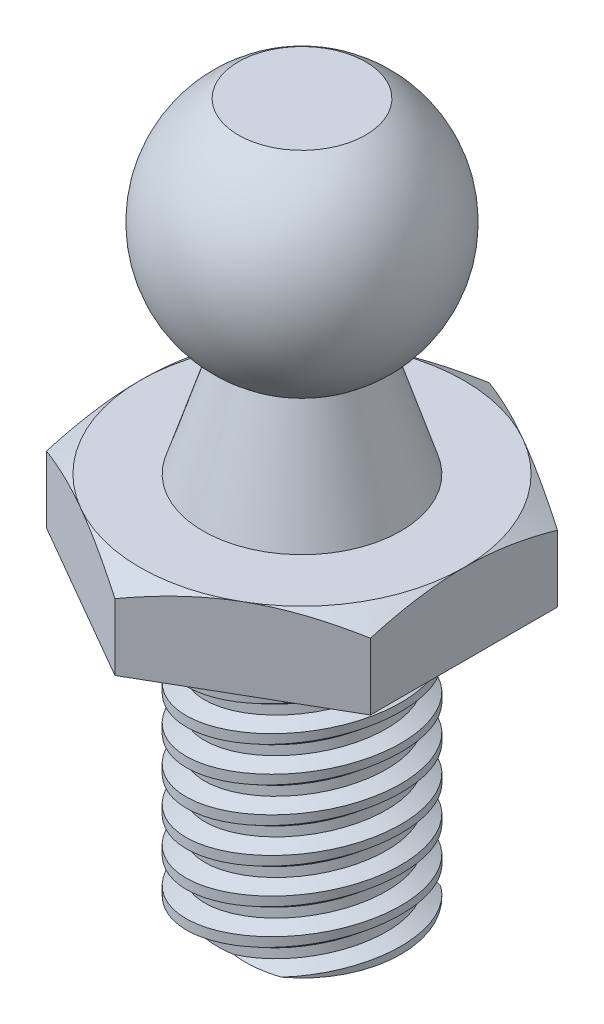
from build123d import *

# Parameters (mm, degrees)
LPATTERN1_COUNT             = 10
LPATTERN1_PITCH             = 1.411111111
EXTRUDE1_DEPTH              = 3.25
SKETCH5_OUTSIDE_W           = 94.658
SKETCH5_OUTSIDE_H           = 96.67
SKETCH5_OUTSIDE_R           = 6.5
CUT_EXTRUDE1_DEPTH          = 20.903412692
CUT_EXTRUDE1_DRAFT          = -60
SKETCH6_W                   = 7.9375
SKETCH6_H                   = 2.54
REMOVE_10_FROM_LENGTH_DEPTH = 4.7625


with BuildPart() as part:
    # Sketch1 → Revolve1 (revolve)
    with BuildSketch(Plane.XY):
        with BuildLine():
            Line((0, -15.15), (0, 15.15))
            Line((0, 15.15), (2.551470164, 15.15))
            ThreePointArc((2.551470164, 15.15), (5, 10.85), (2.551470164, 6.55))
            Line((2.551470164, 6.55), (3.96875, 2.1))
            Line((3.96875, 2.1), (6.5, 2.1))
            Line((6.5, 2.1), (6.5, -1.15))
            Line((6.5, -1.15), (3.96875, -1.15))
            Line((3.96875, -1.15), (3.96875, -15.15))
            Line((3.96875, -15.15), (0, -15.15))
        make_face()
    revolve(axis=Axis((0, -15.15, 0), (0, -1, 0)))

    # Sketch2 → Cut-Revolve1 (revolve, cut)
    with BuildSketch(Plane.XY, mode=Mode.PRIVATE) as cut_revolve1_sk:
        Polygon((3.999623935, -1.323665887), (4.215741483, -2.539327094), (3.386561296, -2.238850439), (3.324813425, -1.891518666), align=None)
    cut_revolve1 = revolve(cut_revolve1_sk.sketch.rotate(Axis((-0.268755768, -1.15, 0), (0.17503333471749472, -0.9845625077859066, 0)), 180), axis=Axis((-0.268755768, -1.15, 0), (0.17503333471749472, -0.9845625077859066, 0)), mode=Mode.SUBTRACT)

    # Sketch3 → Cut-Revolve2 (revolve, cut)
    with BuildSketch(Plane.XY, mode=Mode.PRIVATE) as cut_revolve2_sk:
        Polygon((3.324813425, -15.15), (3.96875, -15.15), (3.96875, -13.769073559), align=None)
    revolve(cut_revolve2_sk.sketch.rotate(Axis((0, -15.15, 0), (0, 1, 0)), 180), axis=Axis((0, -15.15, 0), (0, 1, 0)), mode=Mode.SUBTRACT)

    # LPattern1: Cut-Revolve1 ×10
    with Locations(*[(0, -i * LPATTERN1_PITCH, 0) for i in range(1, LPATTERN1_COUNT)]):
        add(cut_revolve1, mode=Mode.SUBTRACT)

    # Sketch4 → Extrude1 (add)
    with BuildSketch(Plane.XZ.offset(1.15)):
        Polygon((6.5, 3.75277675), (0, 7.505553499), (-6.5, 3.75277675), (-6.5, -3.75277675), (0, -7.505553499), (6.5, -3.75277675), align=None)
    extrude(amount=-EXTRUDE1_DEPTH)


with BuildPart() as cut_extrude1_tool:
    # Sketch5 outside → Cut-Extrude1 (with draft: the straight prism first)
    with BuildSketch(Plane(origin=(0, 2.1, 0), x_dir=(-1, 0, 0), z_dir=(0, 1, 0))):
        Rectangle(SKETCH5_OUTSIDE_W, SKETCH5_OUTSIDE_H)
        Circle(SKETCH5_OUTSIDE_R, mode=Mode.SUBTRACT)
    extrude(amount=-CUT_EXTRUDE1_DEPTH)
    # Cut-Extrude1: the draft: its side faces are tilted about the plane it starts from
    cut_extrude1_sides = [cut_extrude1_tool.faces().sort_by_distance(p)[0] for p in [
        (0, -8.351706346, -48.335),
        (-47.329, -8.351706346, 0),
        (0, -8.351706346, 48.335),
        (47.329, -8.351706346, 0),
        (6.5, -8.351706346, 0),
    ]]
    draft(cut_extrude1_sides, Plane(origin=(0, 2.1, 0), x_dir=(-1, 0, 0), z_dir=(0, 1, 0)), CUT_EXTRUDE1_DRAFT)


with BuildPart() as part_1:
    add(part.part)

    # Cut-Extrude1: cut by cut_extrude1_tool
    add(cut_extrude1_tool.part, mode=Mode.SUBTRACT)

    # Sketch6 → Remove .10_ From Length (cut, symmetric)
    with BuildSketch(Plane.XY):
        with Locations((0, -13.88)):
            Rectangle(SKETCH6_W, SKETCH6_H)
    extrude(amount=REMOVE_10_FROM_LENGTH_DEPTH, both=True, mode=Mode.SUBTRACT)


solid = part_1.part
